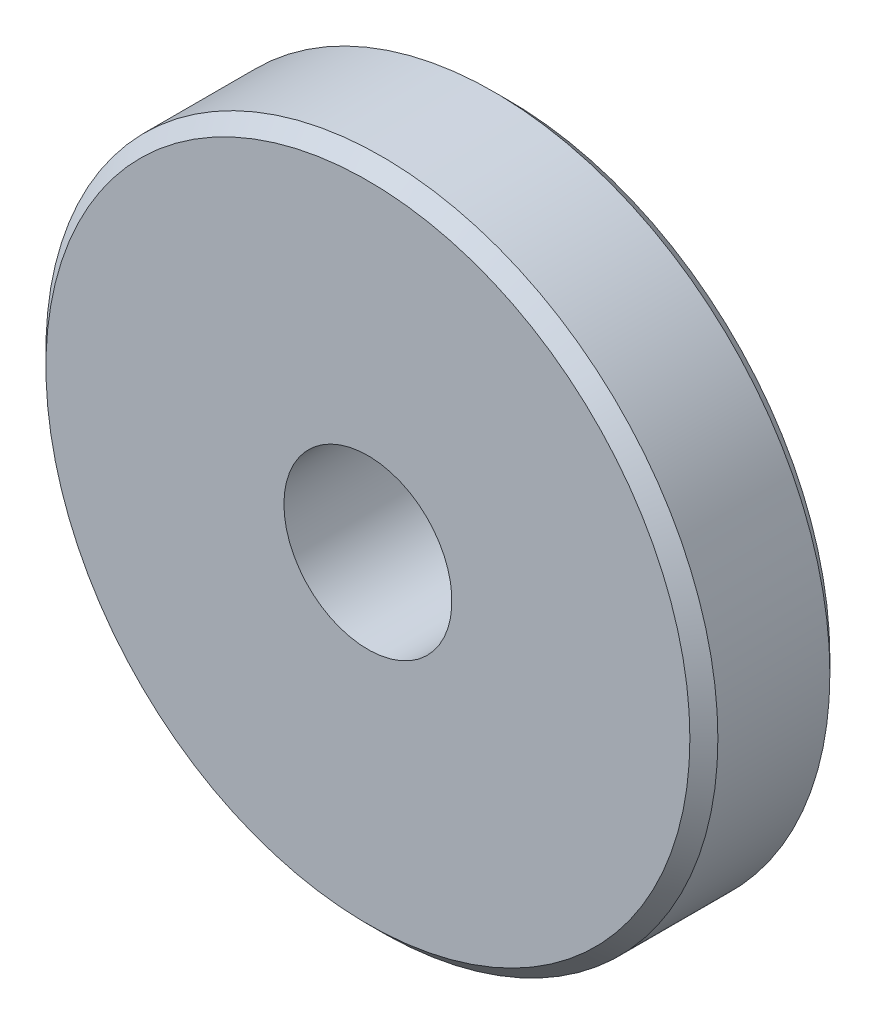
ISO-10303-21;
HEADER;
FILE_DESCRIPTION(('STEP AP214'),'2;1');
FILE_NAME('part.step','',(''),(''),'','','');
FILE_SCHEMA(('AUTOMOTIVE_DESIGN { 1 0 10303 214 1 1 1 1 }'));
ENDSEC;
DATA;
#1=APPLICATION_CONTEXT('core data for automotive mechanical design processes');
#2=APPLICATION_PROTOCOL_DEFINITION('international standard','automotive_design',2000,#1);
#3=PRODUCT_CONTEXT('',#1,'mechanical');
#4=PRODUCT('Part','Part','',(#3));
#5=PRODUCT_RELATED_PRODUCT_CATEGORY('part','',(#4));
#6=PRODUCT_DEFINITION_FORMATION('','',#4);
#7=PRODUCT_DEFINITION_CONTEXT('part definition',#1,'design');
#8=PRODUCT_DEFINITION('design','',#6,#7);
#9=PRODUCT_DEFINITION_SHAPE('','',#8);
#10=(LENGTH_UNIT() NAMED_UNIT(*) SI_UNIT(.MILLI.,.METRE.));
#11=(NAMED_UNIT(*) PLANE_ANGLE_UNIT() SI_UNIT($,.RADIAN.));
#12=(NAMED_UNIT(*) SI_UNIT($,.STERADIAN.) SOLID_ANGLE_UNIT());
#13=UNCERTAINTY_MEASURE_WITH_UNIT(LENGTH_MEASURE(1.E-05),#10,'distance_accuracy_value','');
#14=(GEOMETRIC_REPRESENTATION_CONTEXT(3) GLOBAL_UNCERTAINTY_ASSIGNED_CONTEXT((#13)) GLOBAL_UNIT_ASSIGNED_CONTEXT((#10,
#11,#12)) REPRESENTATION_CONTEXT('',''));
#15=CARTESIAN_POINT('',(0.,0.,0.));
#16=DIRECTION('',(0.,0.,1.));
#17=DIRECTION('',(1.,0.,0.));
#18=AXIS2_PLACEMENT_3D('',#15,#16,#17);
#19=CARTESIAN_POINT('',(0.,0.,1.));
#20=DIRECTION('',(0.,0.,-1.));
#21=DIRECTION('',(-1.,0.,0.));
#22=AXIS2_PLACEMENT_3D('',#19,#20,#21);
#23=CYLINDRICAL_SURFACE('',#22,6.);
#24=CARTESIAN_POINT('',(0.,0.,0.51));
#25=DIRECTION('',(0.,0.,1.));
#26=DIRECTION('',(1.,0.,0.));
#27=AXIS2_PLACEMENT_3D('',#24,#25,#26);
#28=CIRCLE('',#27,6.);
#29=CARTESIAN_POINT('',(6.,0.,0.51));
#30=VERTEX_POINT('',#29);
#31=EDGE_CURVE('E8',#30,#30,#28,.F.);
#32=ORIENTED_EDGE('',*,*,#31,.T.);
#33=EDGE_LOOP('',(#32));
#34=FACE_BOUND('',#33,.T.);
#35=CARTESIAN_POINT('',(0.,0.,0.));
#36=DIRECTION('',(0.,0.,1.));
#37=DIRECTION('',(1.,0.,0.));
#38=AXIS2_PLACEMENT_3D('',#35,#36,#37);
#39=CIRCLE('',#38,6.);
#40=CARTESIAN_POINT('',(6.,0.,0.));
#41=VERTEX_POINT('',#40);
#42=EDGE_CURVE('E38',#41,#41,#39,.T.);
#43=ORIENTED_EDGE('',*,*,#42,.T.);
#44=EDGE_LOOP('',(#43));
#45=FACE_BOUND('',#44,.T.);
#46=ADVANCED_FACE('F12',(#34,#45),#23,.T.);
#47=CARTESIAN_POINT('',(0.,0.,0.));
#48=DIRECTION('',(0.,0.,1.));
#49=DIRECTION('',(1.,0.,0.));
#50=AXIS2_PLACEMENT_3D('',#47,#48,#49);
#51=PLANE('',#50);
#52=CARTESIAN_POINT('',(0.,0.,0.));
#53=DIRECTION('',(0.,0.,-1.));
#54=DIRECTION('',(-1.,0.,0.));
#55=AXIS2_PLACEMENT_3D('',#52,#53,#54);
#56=CIRCLE('',#55,3.);
#57=CARTESIAN_POINT('',(-3.,0.,0.));
#58=VERTEX_POINT('',#57);
#59=EDGE_CURVE('E42',#58,#58,#56,.T.);
#60=ORIENTED_EDGE('',*,*,#59,.F.);
#61=EDGE_LOOP('',(#60));
#62=FACE_BOUND('',#61,.T.);
#63=ORIENTED_EDGE('',*,*,#42,.F.);
#64=EDGE_LOOP('',(#63));
#65=FACE_BOUND('',#64,.T.);
#66=ADVANCED_FACE('F57',(#62,#65),#51,.F.);
#67=CARTESIAN_POINT('',(0.,0.,1.));
#68=DIRECTION('',(0.,0.,1.));
#69=DIRECTION('',(1.,0.,0.));
#70=AXIS2_PLACEMENT_3D('',#67,#68,#69);
#71=PLANE('',#70);
#72=CARTESIAN_POINT('',(0.,0.,1.));
#73=DIRECTION('',(0.,0.,1.));
#74=DIRECTION('',(1.,0.,0.));
#75=AXIS2_PLACEMENT_3D('',#72,#73,#74);
#76=CIRCLE('',#75,6.49);
#77=CARTESIAN_POINT('',(6.49,0.,1.));
#78=VERTEX_POINT('',#77);
#79=EDGE_CURVE('E19',#78,#78,#76,.T.);
#80=ORIENTED_EDGE('',*,*,#79,.T.);
#81=EDGE_LOOP('',(#80));
#82=FACE_BOUND('',#81,.T.);
#83=CARTESIAN_POINT('',(0.,0.,1.));
#84=DIRECTION('',(0.,0.,1.));
#85=DIRECTION('',(1.,0.,0.));
#86=AXIS2_PLACEMENT_3D('',#83,#84,#85);
#87=CIRCLE('',#86,11.5);
#88=CARTESIAN_POINT('',(11.5,0.,1.));
#89=VERTEX_POINT('',#88);
#90=EDGE_CURVE('E27',#89,#89,#87,.F.);
#91=ORIENTED_EDGE('',*,*,#90,.T.);
#92=EDGE_LOOP('',(#91));
#93=FACE_BOUND('',#92,.T.);
#94=ADVANCED_FACE('F60',(#82,#93),#71,.F.);
#95=CARTESIAN_POINT('',(0.,0.,6.));
#96=DIRECTION('',(0.,0.,-1.));
#97=DIRECTION('',(-1.,0.,0.));
#98=AXIS2_PLACEMENT_3D('',#95,#96,#97);
#99=CYLINDRICAL_SURFACE('',#98,12.);
#100=CARTESIAN_POINT('',(0.,0.,1.5));
#101=DIRECTION('',(0.,0.,1.));
#102=DIRECTION('',(1.,0.,0.));
#103=AXIS2_PLACEMENT_3D('',#100,#101,#102);
#104=CIRCLE('',#103,12.);
#105=CARTESIAN_POINT('',(12.,0.,1.5));
#106=VERTEX_POINT('',#105);
#107=EDGE_CURVE('E32',#106,#106,#104,.T.);
#108=ORIENTED_EDGE('',*,*,#107,.T.);
#109=EDGE_LOOP('',(#108));
#110=FACE_BOUND('',#109,.T.);
#111=CARTESIAN_POINT('',(0.,0.,5.5));
#112=DIRECTION('',(0.,0.,1.));
#113=DIRECTION('',(1.,0.,0.));
#114=AXIS2_PLACEMENT_3D('',#111,#112,#113);
#115=CIRCLE('',#114,12.);
#116=CARTESIAN_POINT('',(12.,0.,5.5));
#117=VERTEX_POINT('',#116);
#118=EDGE_CURVE('E35',#117,#117,#115,.F.);
#119=ORIENTED_EDGE('',*,*,#118,.T.);
#120=EDGE_LOOP('',(#119));
#121=FACE_BOUND('',#120,.T.);
#122=ADVANCED_FACE('F85',(#110,#121),#99,.T.);
#123=CARTESIAN_POINT('',(0.,0.,6.));
#124=DIRECTION('',(0.,0.,1.));
#125=DIRECTION('',(1.,0.,0.));
#126=AXIS2_PLACEMENT_3D('',#123,#124,#125);
#127=PLANE('',#126);
#128=CARTESIAN_POINT('',(0.,0.,6.));
#129=DIRECTION('',(0.,0.,1.));
#130=DIRECTION('',(1.,0.,0.));
#131=AXIS2_PLACEMENT_3D('',#128,#129,#130);
#132=CIRCLE('',#131,11.5);
#133=CARTESIAN_POINT('',(11.5,0.,6.));
#134=VERTEX_POINT('',#133);
#135=EDGE_CURVE('E23',#134,#134,#132,.T.);
#136=ORIENTED_EDGE('',*,*,#135,.T.);
#137=EDGE_LOOP('',(#136));
#138=FACE_BOUND('',#137,.T.);
#139=CARTESIAN_POINT('',(0.,0.,6.));
#140=DIRECTION('',(0.,0.,-1.));
#141=DIRECTION('',(-1.,0.,0.));
#142=AXIS2_PLACEMENT_3D('',#139,#140,#141);
#143=CIRCLE('',#142,3.);
#144=CARTESIAN_POINT('',(-3.,0.,6.));
#145=VERTEX_POINT('',#144);
#146=EDGE_CURVE('E41',#145,#145,#143,.T.);
#147=ORIENTED_EDGE('',*,*,#146,.T.);
#148=EDGE_LOOP('',(#147));
#149=FACE_BOUND('',#148,.T.);
#150=ADVANCED_FACE('F48',(#138,#149),#127,.T.);
#151=CARTESIAN_POINT('',(0.,0.,6.));
#152=DIRECTION('',(0.,0.,-1.));
#153=DIRECTION('',(-1.,0.,0.));
#154=AXIS2_PLACEMENT_3D('',#151,#152,#153);
#155=CYLINDRICAL_SURFACE('',#154,3.);
#156=ORIENTED_EDGE('',*,*,#146,.F.);
#157=EDGE_LOOP('',(#156));
#158=FACE_BOUND('',#157,.T.);
#159=ORIENTED_EDGE('',*,*,#59,.T.);
#160=EDGE_LOOP('',(#159));
#161=FACE_BOUND('',#160,.T.);
#162=ADVANCED_FACE('F50',(#158,#161),#155,.F.);
#163=CARTESIAN_POINT('',(0.,0.,1.5));
#164=DIRECTION('',(0.,0.,1.));
#165=DIRECTION('',(1.,0.,0.));
#166=AXIS2_PLACEMENT_3D('',#163,#164,#165);
#167=CONICAL_SURFACE('',#166,12.,0.78539816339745);
#168=ORIENTED_EDGE('',*,*,#90,.F.);
#169=EDGE_LOOP('',(#168));
#170=FACE_BOUND('',#169,.T.);
#171=ORIENTED_EDGE('',*,*,#107,.F.);
#172=EDGE_LOOP('',(#171));
#173=FACE_BOUND('',#172,.T.);
#174=ADVANCED_FACE('F53',(#170,#173),#167,.T.);
#175=CARTESIAN_POINT('',(0.,0.,6.));
#176=DIRECTION('',(0.,0.,-1.));
#177=DIRECTION('',(-1.,0.,0.));
#178=AXIS2_PLACEMENT_3D('',#175,#176,#177);
#179=CONICAL_SURFACE('',#178,11.5,0.785398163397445);
#180=ORIENTED_EDGE('',*,*,#118,.F.);
#181=EDGE_LOOP('',(#180));
#182=FACE_BOUND('',#181,.T.);
#183=ORIENTED_EDGE('',*,*,#135,.F.);
#184=EDGE_LOOP('',(#183));
#185=FACE_BOUND('',#184,.T.);
#186=ADVANCED_FACE('F72',(#182,#185),#179,.T.);
#187=CARTESIAN_POINT('',(0.,0.,0.51));
#188=DIRECTION('',(0.,0.,1.));
#189=DIRECTION('',(1.,0.,0.));
#190=AXIS2_PLACEMENT_3D('',#187,#188,#189);
#191=TOROIDAL_SURFACE('',#190,6.49,0.49);
#192=ORIENTED_EDGE('',*,*,#31,.F.);
#193=EDGE_LOOP('',(#192));
#194=FACE_BOUND('',#193,.T.);
#195=ORIENTED_EDGE('',*,*,#79,.F.);
#196=EDGE_LOOP('',(#195));
#197=FACE_BOUND('',#196,.T.);
#198=ADVANCED_FACE('F14',(#194,#197),#191,.F.);
#199=CLOSED_SHELL('',(#46,#66,#94,#122,#150,#162,#174,#186,#198));
#200=MANIFOLD_SOLID_BREP('B1',#199);
#201=ADVANCED_BREP_SHAPE_REPRESENTATION('',(#18,#200),#14);
#202=SHAPE_DEFINITION_REPRESENTATION(#9,#201);
ENDSEC;
END-ISO-10303-21;
